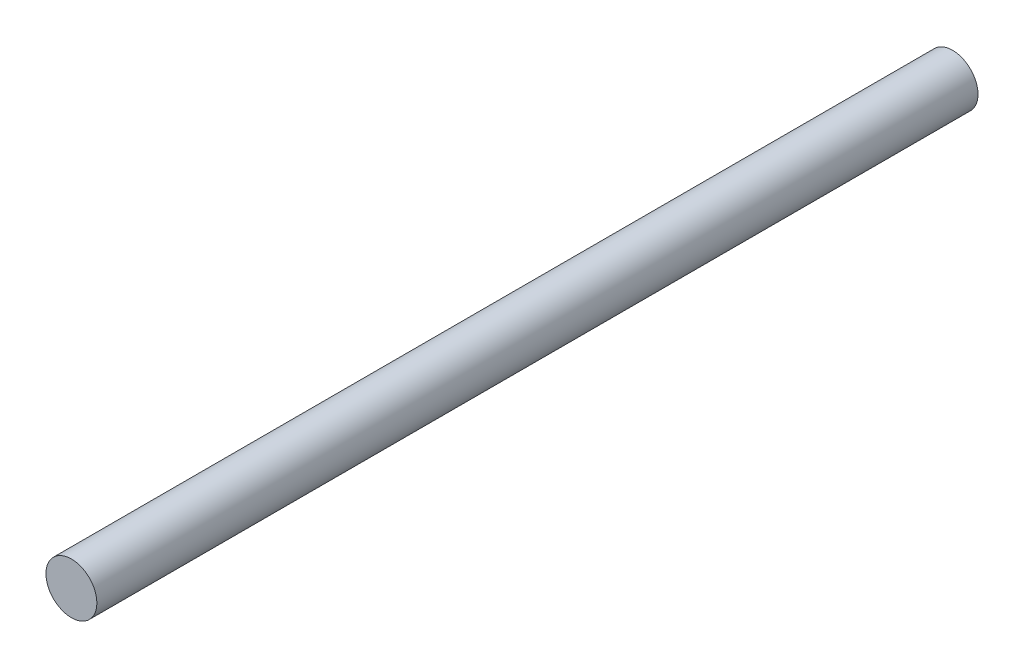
from build123d import *

# Parameters (mm, degrees)
SKETCH1_R           = 6.5
BOSS_EXTRUDE1_DEPTH = 225


with BuildPart() as part:
    # Sketch1 → Boss-Extrude1 (new body)
    with BuildSketch(Plane.XY):
        Circle(SKETCH1_R)
    extrude(amount=BOSS_EXTRUDE1_DEPTH)


solid = part.part
